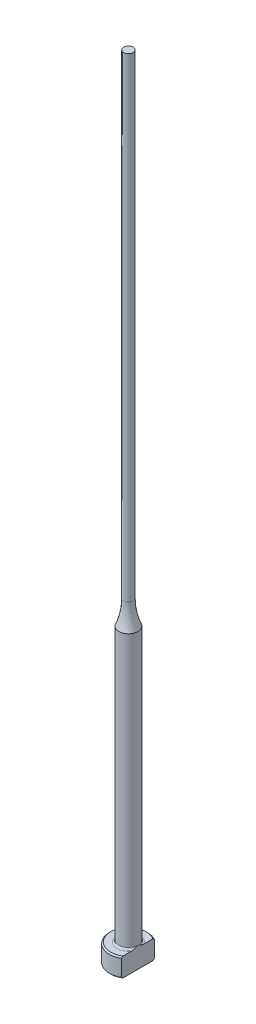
ISO-10303-21;
HEADER;
FILE_DESCRIPTION(('STEP AP214'),'2;1');
FILE_NAME('part.step','',(''),(''),'','','');
FILE_SCHEMA(('AUTOMOTIVE_DESIGN { 1 0 10303 214 1 1 1 1 }'));
ENDSEC;
DATA;
#1=APPLICATION_CONTEXT('core data for automotive mechanical design processes');
#2=APPLICATION_PROTOCOL_DEFINITION('international standard','automotive_design',2000,#1);
#3=PRODUCT_CONTEXT('',#1,'mechanical');
#4=PRODUCT('Part','Part','',(#3));
#5=PRODUCT_RELATED_PRODUCT_CATEGORY('part','',(#4));
#6=PRODUCT_DEFINITION_FORMATION('','',#4);
#7=PRODUCT_DEFINITION_CONTEXT('part definition',#1,'design');
#8=PRODUCT_DEFINITION('design','',#6,#7);
#9=PRODUCT_DEFINITION_SHAPE('','',#8);
#10=(LENGTH_UNIT() NAMED_UNIT(*) SI_UNIT(.MILLI.,.METRE.));
#11=(NAMED_UNIT(*) PLANE_ANGLE_UNIT() SI_UNIT($,.RADIAN.));
#12=(NAMED_UNIT(*) SI_UNIT($,.STERADIAN.) SOLID_ANGLE_UNIT());
#13=UNCERTAINTY_MEASURE_WITH_UNIT(LENGTH_MEASURE(1.E-05),#10,'distance_accuracy_value','');
#14=(GEOMETRIC_REPRESENTATION_CONTEXT(3) GLOBAL_UNCERTAINTY_ASSIGNED_CONTEXT((#13)) GLOBAL_UNIT_ASSIGNED_CONTEXT((#10,
#11,#12)) REPRESENTATION_CONTEXT('',''));
#15=CARTESIAN_POINT('',(0.,0.,0.));
#16=DIRECTION('',(0.,0.,1.));
#17=DIRECTION('',(1.,0.,0.));
#18=AXIS2_PLACEMENT_3D('',#15,#16,#17);
#19=CARTESIAN_POINT('',(-2.99999999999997,3.,0.));
#20=DIRECTION('',(0.,1.,0.));
#21=DIRECTION('',(0.,0.,1.));
#22=AXIS2_PLACEMENT_3D('',#19,#20,#21);
#23=PLANE('',#22);
#24=CARTESIAN_POINT('',(0.,3.,0.));
#25=DIRECTION('',(0.,1.,0.));
#26=DIRECTION('',(0.,0.,1.));
#27=AXIS2_PLACEMENT_3D('',#24,#25,#26);
#28=CIRCLE('',#27,2.79999999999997);
#29=CARTESIAN_POINT('',(1.49999999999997,3.,-2.36431808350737));
#30=VERTEX_POINT('',#29);
#31=CARTESIAN_POINT('',(1.49999999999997,3.,2.36431808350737));
#32=VERTEX_POINT('',#31);
#33=EDGE_CURVE('E187',#30,#32,#28,.T.);
#34=ORIENTED_EDGE('',*,*,#33,.T.);
#35=DIRECTION('',(0.,0.,-1.));
#36=VECTOR('',#35,1.);
#37=CARTESIAN_POINT('',(1.49999999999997,3.,0.));
#38=LINE('',#37,#36);
#39=CARTESIAN_POINT('',(1.49999999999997,3.00000000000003,0.99498743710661));
#40=VERTEX_POINT('',#39);
#41=EDGE_CURVE('E57',#32,#40,#38,.T.);
#42=ORIENTED_EDGE('',*,*,#41,.T.);
#43=CARTESIAN_POINT('',(0.,3.,0.));
#44=DIRECTION('',(0.,1.,0.));
#45=DIRECTION('',(0.,0.,1.));
#46=AXIS2_PLACEMENT_3D('',#43,#44,#45);
#47=CIRCLE('',#46,1.79999999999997);
#48=CARTESIAN_POINT('',(1.49999999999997,3.00000000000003,-0.994987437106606));
#49=VERTEX_POINT('',#48);
#50=EDGE_CURVE('E108',#40,#49,#47,.F.);
#51=ORIENTED_EDGE('',*,*,#50,.T.);
#52=EDGE_CURVE('E137',#49,#30,#38,.T.);
#53=ORIENTED_EDGE('',*,*,#52,.T.);
#54=EDGE_LOOP('',(#34,#42,#51,#53));
#55=FACE_BOUND('',#54,.T.);
#56=ADVANCED_FACE('F32',(#55),#23,.T.);
#57=CARTESIAN_POINT('',(0.,259.958771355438,0.));
#58=DIRECTION('',(0.,1.,0.));
#59=DIRECTION('',(0.,0.,1.));
#60=AXIS2_PLACEMENT_3D('',#57,#58,#59);
#61=CYLINDRICAL_SURFACE('',#60,2.99999999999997);
#62=CARTESIAN_POINT('',(0.,2.80000000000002,0.));
#63=DIRECTION('',(0.,1.,0.));
#64=DIRECTION('',(0.,0.,1.));
#65=AXIS2_PLACEMENT_3D('',#62,#63,#64);
#66=CIRCLE('',#65,2.99999999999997);
#67=CARTESIAN_POINT('',(1.49999999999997,2.80000000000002,2.5980762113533));
#68=VERTEX_POINT('',#67);
#69=CARTESIAN_POINT('',(1.49999999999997,2.80000000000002,-2.5980762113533));
#70=VERTEX_POINT('',#69);
#71=EDGE_CURVE('E105',#68,#70,#66,.F.);
#72=ORIENTED_EDGE('',*,*,#71,.T.);
#73=DIRECTION('',(0.,-1.,0.));
#74=VECTOR('',#73,1.);
#75=CARTESIAN_POINT('',(1.49999999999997,125.,-2.5980762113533));
#76=LINE('',#75,#74);
#77=CARTESIAN_POINT('',(1.49999999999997,0.200000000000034,-2.5980762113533));
#78=VERTEX_POINT('',#77);
#79=EDGE_CURVE('E193',#70,#78,#76,.T.);
#80=ORIENTED_EDGE('',*,*,#79,.T.);
#81=CARTESIAN_POINT('',(0.,0.200000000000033,0.));
#82=DIRECTION('',(0.,-1.,0.));
#83=DIRECTION('',(0.,0.,-1.));
#84=AXIS2_PLACEMENT_3D('',#81,#82,#83);
#85=CIRCLE('',#84,2.99999999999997);
#86=CARTESIAN_POINT('',(1.49999999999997,0.200000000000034,2.5980762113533));
#87=VERTEX_POINT('',#86);
#88=EDGE_CURVE('E100',#78,#87,#85,.F.);
#89=ORIENTED_EDGE('',*,*,#88,.T.);
#90=DIRECTION('',(0.,-1.,0.));
#91=VECTOR('',#90,1.);
#92=CARTESIAN_POINT('',(1.49999999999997,125.,2.5980762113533));
#93=LINE('',#92,#91);
#94=EDGE_CURVE('E93',#68,#87,#93,.T.);
#95=ORIENTED_EDGE('',*,*,#94,.F.);
#96=EDGE_LOOP('',(#72,#80,#89,#95));
#97=FACE_BOUND('',#96,.T.);
#98=ADVANCED_FACE('F158',(#97),#61,.T.);
#99=CARTESIAN_POINT('',(0.,0.,0.));
#100=DIRECTION('',(0.,-1.,0.));
#101=DIRECTION('',(0.,0.,-1.));
#102=AXIS2_PLACEMENT_3D('',#99,#100,#101);
#103=PLANE('',#102);
#104=CARTESIAN_POINT('',(0.,0.,0.));
#105=DIRECTION('',(0.,-1.,0.));
#106=DIRECTION('',(0.,0.,-1.));
#107=AXIS2_PLACEMENT_3D('',#104,#105,#106);
#108=CIRCLE('',#107,2.79999999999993);
#109=CARTESIAN_POINT('',(1.49999999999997,0.,2.36431808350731));
#110=VERTEX_POINT('',#109);
#111=CARTESIAN_POINT('',(1.49999999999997,0.,-2.36431808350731));
#112=VERTEX_POINT('',#111);
#113=EDGE_CURVE('E98',#110,#112,#108,.T.);
#114=ORIENTED_EDGE('',*,*,#113,.T.);
#115=DIRECTION('',(0.,0.,1.));
#116=VECTOR('',#115,1.);
#117=CARTESIAN_POINT('',(1.49999999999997,0.,-2.5980762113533));
#118=LINE('',#117,#116);
#119=EDGE_CURVE('E83',#112,#110,#118,.T.);
#120=ORIENTED_EDGE('',*,*,#119,.T.);
#121=EDGE_LOOP('',(#114,#120));
#122=FACE_BOUND('',#121,.T.);
#123=ADVANCED_FACE('F103',(#122),#103,.T.);
#124=CARTESIAN_POINT('',(0.,3.,0.));
#125=DIRECTION('',(0.,-1.,0.));
#126=DIRECTION('',(0.,0.,-1.));
#127=AXIS2_PLACEMENT_3D('',#124,#125,#126);
#128=CONICAL_SURFACE('',#127,2.79999999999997,0.7853981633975);
#129=ORIENTED_EDGE('',*,*,#71,.F.);
#130=CARTESIAN_POINT('',(1.49999999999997,-0.11174109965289,5.71827621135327));
#131=CARTESIAN_POINT('',(1.49999999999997,0.0136183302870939,5.58866816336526));
#132=CARTESIAN_POINT('',(1.49999999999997,0.138843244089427,5.45892957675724));
#133=CARTESIAN_POINT('',(1.49999999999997,0.388944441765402,5.19911365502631));
#134=CARTESIAN_POINT('',(1.49999999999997,0.513820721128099,5.06903631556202));
#135=CARTESIAN_POINT('',(1.49999999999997,0.763205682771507,4.8084018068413));
#136=CARTESIAN_POINT('',(1.49999999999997,0.887714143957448,4.67784442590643));
#137=CARTESIAN_POINT('',(1.49999999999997,1.13618059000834,4.41620813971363));
#138=CARTESIAN_POINT('',(1.49999999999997,1.2601385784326,4.28512923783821));
#139=CARTESIAN_POINT('',(1.49999999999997,1.50488975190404,4.02490837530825));
#140=CARTESIAN_POINT('',(1.49999999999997,1.6256969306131,3.89577958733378));
#141=CARTESIAN_POINT('',(1.49999999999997,1.86640694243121,3.63668213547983));
#142=CARTESIAN_POINT('',(1.49999999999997,1.98630978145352,3.5067134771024));
#143=CARTESIAN_POINT('',(1.49999999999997,2.22486033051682,3.24567921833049));
#144=CARTESIAN_POINT('',(1.49999999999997,2.34350830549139,3.11461386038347));
#145=CARTESIAN_POINT('',(1.49999999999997,2.57907716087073,2.85094268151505));
#146=CARTESIAN_POINT('',(1.49999999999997,2.69599811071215,2.71833692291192));
#147=CARTESIAN_POINT('',(1.49999999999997,2.88262371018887,2.50255231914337));
#148=CARTESIAN_POINT('',(1.49999999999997,2.95312454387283,2.42006293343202));
#149=CARTESIAN_POINT('',(1.49999999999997,3.09287098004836,2.25401084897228));
#150=CARTESIAN_POINT('',(1.49999999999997,3.16211645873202,2.170448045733));
#151=CARTESIAN_POINT('',(1.49999999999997,3.2996468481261,2.00105967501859));
#152=CARTESIAN_POINT('',(1.49999999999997,3.36791386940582,1.91521952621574));
#153=CARTESIAN_POINT('',(1.49999999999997,3.50205840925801,1.74171392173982));
#154=CARTESIAN_POINT('',(1.49999999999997,3.56793649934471,1.65404891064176));
#155=CARTESIAN_POINT('',(1.49999999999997,3.69728151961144,1.47490236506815));
#156=CARTESIAN_POINT('',(1.49999999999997,3.76069661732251,1.38338308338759));
#157=CARTESIAN_POINT('',(1.49999999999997,3.88239539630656,1.1967566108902));
#158=CARTESIAN_POINT('',(1.49999999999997,3.94067201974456,1.10164473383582));
#159=CARTESIAN_POINT('',(1.49999999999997,4.0484132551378,0.908008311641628));
#160=CARTESIAN_POINT('',(1.49999999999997,4.09797809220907,0.809540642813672));
#161=CARTESIAN_POINT('',(1.49999999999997,4.18432188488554,0.607192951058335));
#162=CARTESIAN_POINT('',(1.49999999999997,4.22114374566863,0.503332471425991));
#163=CARTESIAN_POINT('',(1.49999999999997,4.26099935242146,0.347577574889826));
#164=CARTESIAN_POINT('',(1.49999999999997,4.27157029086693,0.29760995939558));
#165=CARTESIAN_POINT('',(1.49999999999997,4.28794860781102,0.196885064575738));
#166=CARTESIAN_POINT('',(1.49999999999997,4.29375640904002,0.146127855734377));
#167=CARTESIAN_POINT('',(1.49999999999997,4.30019707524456,0.0444388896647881));
#168=CARTESIAN_POINT('',(1.49999999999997,4.30084594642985,-0.00649183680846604));
#169=CARTESIAN_POINT('',(1.49999999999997,4.29696416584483,-0.108155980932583));
#170=CARTESIAN_POINT('',(1.49999999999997,4.29243308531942,-0.158889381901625));
#171=CARTESIAN_POINT('',(1.49999999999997,4.27856915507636,-0.259234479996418));
#172=CARTESIAN_POINT('',(1.49999999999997,4.26927821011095,-0.308852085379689));
#173=CARTESIAN_POINT('',(1.49999999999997,4.24647108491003,-0.407110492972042));
#174=CARTESIAN_POINT('',(1.49999999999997,4.2329532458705,-0.455750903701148));
#175=CARTESIAN_POINT('',(1.49999999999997,4.20226175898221,-0.552149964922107));
#176=CARTESIAN_POINT('',(1.49999999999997,4.18506801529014,-0.599902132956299));
#177=CARTESIAN_POINT('',(1.49999999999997,4.14771387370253,-0.694205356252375));
#178=CARTESIAN_POINT('',(1.49999999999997,4.12755408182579,-0.740756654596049));
#179=CARTESIAN_POINT('',(1.49999999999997,4.06327696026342,-0.879166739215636));
#180=CARTESIAN_POINT('',(1.49999999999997,4.01551721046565,-0.969329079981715));
#181=CARTESIAN_POINT('',(1.49999999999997,3.91367909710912,-1.1460431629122));
#182=CARTESIAN_POINT('',(1.49999999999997,3.85959300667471,-1.23259031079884));
#183=CARTESIAN_POINT('',(1.49999999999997,3.74697968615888,-1.40321348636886));
#184=CARTESIAN_POINT('',(1.49999999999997,3.68843573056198,-1.48727838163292));
#185=CARTESIAN_POINT('',(1.49999999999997,3.56843845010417,-1.65322187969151));
#186=CARTESIAN_POINT('',(1.49999999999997,3.50698656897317,-1.73510153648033));
#187=CARTESIAN_POINT('',(1.49999999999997,3.38115673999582,-1.89829823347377));
#188=CARTESIAN_POINT('',(1.49999999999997,3.31675092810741,-1.9795936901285));
#189=CARTESIAN_POINT('',(1.49999999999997,3.18634068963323,-2.14090082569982));
#190=CARTESIAN_POINT('',(1.49999999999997,3.12033609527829,-2.22091236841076));
#191=CARTESIAN_POINT('',(1.49999999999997,2.9208643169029,-2.4590650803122));
#192=CARTESIAN_POINT('',(1.49999999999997,2.78562663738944,-2.6157209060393));
#193=CARTESIAN_POINT('',(1.49999999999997,2.53554498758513,-2.90006295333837));
#194=CARTESIAN_POINT('',(1.49999999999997,2.421145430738,-3.02814382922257));
#195=CARTESIAN_POINT('',(1.49999999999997,2.19093557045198,-3.28303767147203));
#196=CARTESIAN_POINT('',(1.49999999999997,2.07512522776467,-3.40985060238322));
#197=CARTESIAN_POINT('',(1.49999999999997,1.72597067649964,-3.78913849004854));
#198=CARTESIAN_POINT('',(1.49999999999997,1.49111760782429,-4.04022177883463));
#199=CARTESIAN_POINT('',(1.49999999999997,1.02882478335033,-4.52992803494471));
#200=CARTESIAN_POINT('',(1.49999999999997,0.801477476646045,-4.76863870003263));
#201=CARTESIAN_POINT('',(1.49999999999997,0.459548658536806,-5.12558036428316));
#202=CARTESIAN_POINT('',(1.49999999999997,0.345484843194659,-5.24430773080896));
#203=CARTESIAN_POINT('',(1.49999999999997,0.117071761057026,-5.48148573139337));
#204=CARTESIAN_POINT('',(1.49999999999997,0.00272249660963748,-5.59993636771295));
#205=CARTESIAN_POINT('',(1.49999999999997,-0.111741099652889,-5.71827621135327));
#206=B_SPLINE_CURVE_WITH_KNOTS('',3,(#130,#131,#132,#133,#134,#135,#136,#137,#138,#139,#140,
#141,#142,#143,#144,#145,#146,#147,#148,#149,#150,#151,#152,#153,#154,#155,#156,#157,#158,#159,
#160,#161,#162,#163,#164,#165,#166,#167,#168,#169,#170,#171,#172,#173,#174,#175,#176,#177,#178,
#179,#180,#181,#182,#183,#184,#185,#186,#187,#188,#189,#190,#191,#192,#193,#194,#195,#196,#197,
#198,#199,#200,#201,#202,#203,#204,#205),.UNSPECIFIED.,.F.,.F.,(4,2,2,2,2,2,2,2,2,2,2,2,2,2,2,2,
2,2,2,2,2,2,2,2,2,2,2,2,2,2,2,2,2,2,2,2,2,4),(0.,0.540943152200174,1.08189327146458,
1.62312052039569,2.16434426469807,2.69482920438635,3.22531067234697,3.75567781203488,
4.28602356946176,4.61155053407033,4.93710943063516,5.26610945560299,5.59503024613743,
5.92894782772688,6.26331713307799,6.59354403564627,6.92264800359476,7.07567478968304,
7.22868799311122,7.38122626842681,7.53377717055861,7.68500755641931,7.83629736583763,
7.98843643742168,8.14054446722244,8.4461879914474,8.75220879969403,9.05944044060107,
9.366521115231,9.677642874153,9.98879742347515,10.6095925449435,11.1247803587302,
11.6399825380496,12.6713544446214,13.6603005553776,14.1542238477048,14.648143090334),.UNSPECIFIED.);
#207=EDGE_CURVE('E136',#68,#32,#206,.T.);
#208=ORIENTED_EDGE('',*,*,#207,.T.);
#209=ORIENTED_EDGE('',*,*,#33,.F.);
#210=EDGE_CURVE('E128',#30,#70,#206,.T.);
#211=ORIENTED_EDGE('',*,*,#210,.T.);
#212=EDGE_LOOP('',(#129,#208,#209,#211));
#213=FACE_BOUND('',#212,.T.);
#214=ADVANCED_FACE('F144',(#213),#128,.T.);
#215=CARTESIAN_POINT('',(0.,0.200000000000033,0.));
#216=DIRECTION('',(0.,1.,0.));
#217=DIRECTION('',(0.,0.,1.));
#218=AXIS2_PLACEMENT_3D('',#215,#216,#217);
#219=CONICAL_SURFACE('',#218,2.99999999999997,0.785398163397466);
#220=ORIENTED_EDGE('',*,*,#88,.F.);
#221=CARTESIAN_POINT('',(1.49999999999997,3.11174109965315,-5.71827621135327));
#222=CARTESIAN_POINT('',(1.49999999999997,2.98638166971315,-5.58866816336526));
#223=CARTESIAN_POINT('',(1.49999999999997,2.8611567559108,-5.45892957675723));
#224=CARTESIAN_POINT('',(1.49999999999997,2.6110555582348,-5.19911365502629));
#225=CARTESIAN_POINT('',(1.49999999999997,2.48617927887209,-5.06903631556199));
#226=CARTESIAN_POINT('',(1.49999999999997,2.23679431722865,-4.80840180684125));
#227=CARTESIAN_POINT('',(1.49999999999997,2.11228585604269,-4.67784442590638));
#228=CARTESIAN_POINT('',(1.49999999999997,1.86381940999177,-4.41620813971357));
#229=CARTESIAN_POINT('',(1.49999999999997,1.7398614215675,-4.28512923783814));
#230=CARTESIAN_POINT('',(1.49999999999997,1.49511024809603,-4.02490837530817));
#231=CARTESIAN_POINT('',(1.49999999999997,1.37430306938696,-3.89577958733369));
#232=CARTESIAN_POINT('',(1.49999999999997,1.13359305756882,-3.63668213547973));
#233=CARTESIAN_POINT('',(1.49999999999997,1.0136902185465,-3.50671347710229));
#234=CARTESIAN_POINT('',(1.49999999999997,0.775139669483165,-3.24567921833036));
#235=CARTESIAN_POINT('',(1.49999999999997,0.656491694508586,-3.11461386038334));
#236=CARTESIAN_POINT('',(1.49999999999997,0.420922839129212,-2.85094268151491));
#237=CARTESIAN_POINT('',(1.49999999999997,0.304001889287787,-2.71833692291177));
#238=CARTESIAN_POINT('',(1.49999999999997,0.117376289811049,-2.50255231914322));
#239=CARTESIAN_POINT('',(1.49999999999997,0.0468754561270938,-2.42006293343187));
#240=CARTESIAN_POINT('',(1.49999999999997,-0.0928709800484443,-2.25401084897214));
#241=CARTESIAN_POINT('',(1.49999999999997,-0.162116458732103,-2.17044804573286));
#242=CARTESIAN_POINT('',(1.49999999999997,-0.299646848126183,-2.00105967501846));
#243=CARTESIAN_POINT('',(1.49999999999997,-0.367913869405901,-1.91521952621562));
#244=CARTESIAN_POINT('',(1.49999999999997,-0.502058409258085,-1.74171392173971));
#245=CARTESIAN_POINT('',(1.49999999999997,-0.567936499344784,-1.65404891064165));
#246=CARTESIAN_POINT('',(1.49999999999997,-0.697281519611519,-1.47490236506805));
#247=CARTESIAN_POINT('',(1.49999999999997,-0.760696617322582,-1.38338308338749));
#248=CARTESIAN_POINT('',(1.49999999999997,-0.882395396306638,-1.19675661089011));
#249=CARTESIAN_POINT('',(1.49999999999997,-0.940672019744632,-1.10164473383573));
#250=CARTESIAN_POINT('',(1.49999999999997,-1.04841325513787,-0.908008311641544));
#251=CARTESIAN_POINT('',(1.49999999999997,-1.09797809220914,-0.809540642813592));
#252=CARTESIAN_POINT('',(1.49999999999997,-1.1843218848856,-0.60719295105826));
#253=CARTESIAN_POINT('',(1.49999999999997,-1.22114374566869,-0.503332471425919));
#254=CARTESIAN_POINT('',(1.49999999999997,-1.26099935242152,-0.347577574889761));
#255=CARTESIAN_POINT('',(1.49999999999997,-1.27157029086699,-0.29760995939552));
#256=CARTESIAN_POINT('',(1.49999999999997,-1.28794860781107,-0.196885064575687));
#257=CARTESIAN_POINT('',(1.49999999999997,-1.29375640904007,-0.146127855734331));
#258=CARTESIAN_POINT('',(1.49999999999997,-1.30019707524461,-0.0444388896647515));
#259=CARTESIAN_POINT('',(1.49999999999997,-1.3008459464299,0.00649183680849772));
#260=CARTESIAN_POINT('',(1.49999999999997,-1.29696416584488,0.108155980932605));
#261=CARTESIAN_POINT('',(1.49999999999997,-1.29243308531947,0.158889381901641));
#262=CARTESIAN_POINT('',(1.49999999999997,-1.2785691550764,0.259234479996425));
#263=CARTESIAN_POINT('',(1.49999999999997,-1.26927821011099,0.308852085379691));
#264=CARTESIAN_POINT('',(1.49999999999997,-1.24647108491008,0.407110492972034));
#265=CARTESIAN_POINT('',(1.49999999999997,-1.23295324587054,0.455750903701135));
#266=CARTESIAN_POINT('',(1.49999999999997,-1.20226175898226,0.552149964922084));
#267=CARTESIAN_POINT('',(1.49999999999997,-1.18506801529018,0.599902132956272));
#268=CARTESIAN_POINT('',(1.49999999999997,-1.14771387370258,0.694205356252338));
#269=CARTESIAN_POINT('',(1.49999999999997,-1.12755408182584,0.740756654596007));
#270=CARTESIAN_POINT('',(1.49999999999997,-1.06327696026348,0.879166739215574));
#271=CARTESIAN_POINT('',(1.49999999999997,-1.01551721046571,0.969329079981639));
#272=CARTESIAN_POINT('',(1.49999999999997,-0.913679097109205,1.1460431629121));
#273=CARTESIAN_POINT('',(1.49999999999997,-0.8595930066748,1.23259031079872));
#274=CARTESIAN_POINT('',(1.49999999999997,-0.746979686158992,1.40321348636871));
#275=CARTESIAN_POINT('',(1.49999999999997,-0.688435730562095,1.48727838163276));
#276=CARTESIAN_POINT('',(1.49999999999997,-0.568438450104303,1.65322187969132));
#277=CARTESIAN_POINT('',(1.49999999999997,-0.506986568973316,1.73510153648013));
#278=CARTESIAN_POINT('',(1.49999999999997,-0.381156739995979,1.89829823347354));
#279=CARTESIAN_POINT('',(1.49999999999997,-0.316750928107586,1.97959369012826));
#280=CARTESIAN_POINT('',(1.49999999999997,-0.186340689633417,2.14090082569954));
#281=CARTESIAN_POINT('',(1.49999999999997,-0.120336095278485,2.22091236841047));
#282=CARTESIAN_POINT('',(1.49999999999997,0.0791356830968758,2.45906508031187));
#283=CARTESIAN_POINT('',(1.49999999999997,0.214373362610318,2.61572090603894));
#284=CARTESIAN_POINT('',(1.49999999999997,0.46445501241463,2.90006295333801));
#285=CARTESIAN_POINT('',(1.49999999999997,0.578854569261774,3.02814382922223));
#286=CARTESIAN_POINT('',(1.49999999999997,0.809064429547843,3.28303767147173));
#287=CARTESIAN_POINT('',(1.49999999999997,0.924874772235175,3.40985060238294));
#288=CARTESIAN_POINT('',(1.49999999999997,1.27402932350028,3.78913849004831));
#289=CARTESIAN_POINT('',(1.49999999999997,1.50888239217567,4.04022177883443));
#290=CARTESIAN_POINT('',(1.49999999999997,1.97117521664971,4.52992803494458));
#291=CARTESIAN_POINT('',(1.49999999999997,2.19852252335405,4.76863870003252));
#292=CARTESIAN_POINT('',(1.49999999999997,2.54045134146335,5.12558036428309));
#293=CARTESIAN_POINT('',(1.49999999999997,2.65451515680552,5.2443077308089));
#294=CARTESIAN_POINT('',(1.49999999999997,2.88292823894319,5.48148573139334));
#295=CARTESIAN_POINT('',(1.49999999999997,2.9972775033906,5.59993636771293));
#296=CARTESIAN_POINT('',(1.49999999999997,3.11174109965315,5.71827621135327));
#297=B_SPLINE_CURVE_WITH_KNOTS('',3,(#221,#222,#223,#224,#225,#226,#227,#228,#229,#230,#231,
#232,#233,#234,#235,#236,#237,#238,#239,#240,#241,#242,#243,#244,#245,#246,#247,#248,#249,#250,
#251,#252,#253,#254,#255,#256,#257,#258,#259,#260,#261,#262,#263,#264,#265,#266,#267,#268,#269,
#270,#271,#272,#273,#274,#275,#276,#277,#278,#279,#280,#281,#282,#283,#284,#285,#286,#287,#288,
#289,#290,#291,#292,#293,#294,#295,#296),.UNSPECIFIED.,.F.,.F.,(4,2,2,2,2,2,2,2,2,2,2,2,2,2,2,2,
2,2,2,2,2,2,2,2,2,2,2,2,2,2,2,2,2,2,2,2,2,4),(0.,0.540943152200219,1.08189327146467,
1.62312052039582,2.16434426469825,2.69482920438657,3.22531067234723,3.75567781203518,
4.28602356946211,4.61155053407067,4.93710943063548,5.2661094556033,5.59503024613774,
5.92894782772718,6.26331713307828,6.59354403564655,6.92264800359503,7.0756747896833,
7.22868799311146,7.38122626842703,7.53377717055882,7.68500755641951,7.83629736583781,
7.98843643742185,8.14054446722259,8.4461879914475,8.75220879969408,9.05944044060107,
9.36652111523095,9.6776428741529,9.98879742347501,10.6095925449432,11.1247803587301,
11.6399825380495,12.6713544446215,13.6603005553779,14.1542238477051,14.6481430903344),.UNSPECIFIED.);
#298=EDGE_CURVE('E86',#78,#112,#297,.T.);
#299=ORIENTED_EDGE('',*,*,#298,.T.);
#300=ORIENTED_EDGE('',*,*,#113,.F.);
#301=EDGE_CURVE('E89',#110,#87,#297,.T.);
#302=ORIENTED_EDGE('',*,*,#301,.T.);
#303=EDGE_LOOP('',(#220,#299,#300,#302));
#304=FACE_BOUND('',#303,.T.);
#305=ADVANCED_FACE('F97',(#304),#219,.T.);
#306=CARTESIAN_POINT('',(0.,3.30000000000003,0.));
#307=DIRECTION('',(0.,1.,0.));
#308=DIRECTION('',(0.,0.,1.));
#309=AXIS2_PLACEMENT_3D('',#306,#307,#308);
#310=TOROIDAL_SURFACE('',#309,1.79999999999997,0.3);
#311=CARTESIAN_POINT('',(1.49999999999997,3.30000000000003,0.));
#312=CARTESIAN_POINT('',(1.49999999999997,3.300000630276,3.41555678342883E-12));
#313=CARTESIAN_POINT('',(1.49999999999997,3.30000126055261,-1.15373640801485E-07));
#314=CARTESIAN_POINT('',(1.49999999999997,3.3000024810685,-4.90631575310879E-07));
#315=CARTESIAN_POINT('',(1.49999999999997,3.30000307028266,-7.53296670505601E-07));
#316=CARTESIAN_POINT('',(1.49999999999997,3.30000424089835,-1.38757096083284E-06));
#317=CARTESIAN_POINT('',(1.49999999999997,3.300004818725,-1.76563001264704E-06));
#318=CARTESIAN_POINT('',(1.49999999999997,3.30000591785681,-2.58768006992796E-06));
#319=CARTESIAN_POINT('',(1.49999999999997,3.30000643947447,-3.03127014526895E-06));
#320=CARTESIAN_POINT('',(1.49999999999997,3.30000815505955,-4.60021967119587E-06));
#321=CARTESIAN_POINT('',(1.49999999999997,3.30000927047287,-5.8124152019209E-06));
#322=CARTESIAN_POINT('',(1.49999999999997,3.30001128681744,-8.33989413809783E-06));
#323=CARTESIAN_POINT('',(1.49999999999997,3.30001219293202,-9.65128157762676E-06));
#324=CARTESIAN_POINT('',(1.49999999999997,3.30001551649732,-1.46782505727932E-05));
#325=CARTESIAN_POINT('',(1.49999999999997,3.30001775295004,-1.8517976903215E-05));
#326=CARTESIAN_POINT('',(1.49999999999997,3.30002148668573,-2.61616194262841E-05));
#327=CARTESIAN_POINT('',(1.49999999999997,3.30002302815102,-2.99447742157E-05));
#328=CARTESIAN_POINT('',(1.49999999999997,3.30002943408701,-4.58003743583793E-05));
#329=CARTESIAN_POINT('',(1.49999999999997,3.3000341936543,-5.79079078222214E-05));
#330=CARTESIAN_POINT('',(1.49999999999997,3.30004197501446,-8.07263755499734E-05));
#331=CARTESIAN_POINT('',(1.49999999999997,3.30004514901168,-9.13834709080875E-05));
#332=CARTESIAN_POINT('',(1.49999999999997,3.30006989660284,-0.000167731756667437));
#333=CARTESIAN_POINT('',(1.49999999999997,3.30010092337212,-0.000229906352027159));
#334=CARTESIAN_POINT('',(1.49999999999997,3.30021632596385,-0.000470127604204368));
#335=CARTESIAN_POINT('',(1.49999999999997,3.30029368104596,-0.000650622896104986));
#336=CARTESIAN_POINT('',(1.49999999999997,3.30059619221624,-0.00134589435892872));
#337=CARTESIAN_POINT('',(1.49999999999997,3.30082870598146,-0.00185814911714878));
#338=CARTESIAN_POINT('',(1.49999999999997,3.30176696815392,-0.00393547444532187));
#339=CARTESIAN_POINT('',(1.49999999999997,3.30246445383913,-0.00550332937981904));
#340=CARTESIAN_POINT('',(1.49999999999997,3.31426785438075,-0.0320229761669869));
#341=CARTESIAN_POINT('',(1.49999999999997,3.32544800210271,-0.0569503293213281));
#342=CARTESIAN_POINT('',(1.49999999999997,3.34725700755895,-0.105984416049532));
#343=CARTESIAN_POINT('',(1.49999999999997,3.35789134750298,-0.130088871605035));
#344=CARTESIAN_POINT('',(1.49999999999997,3.38015321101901,-0.181096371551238));
#345=CARTESIAN_POINT('',(1.49999999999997,3.39175804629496,-0.208009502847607));
#346=CARTESIAN_POINT('',(1.49999999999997,3.41469034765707,-0.262264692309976));
#347=CARTESIAN_POINT('',(1.49999999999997,3.42601398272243,-0.289608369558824));
#348=CARTESIAN_POINT('',(1.49999999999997,3.45363212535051,-0.35820378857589));
#349=CARTESIAN_POINT('',(1.49999999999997,3.46959026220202,-0.39959288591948));
#350=CARTESIAN_POINT('',(1.49999999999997,3.49940505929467,-0.482097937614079));
#351=CARTESIAN_POINT('',(1.49999999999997,3.51330033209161,-0.523199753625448));
#352=CARTESIAN_POINT('',(1.49999999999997,3.53552507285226,-0.595497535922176));
#353=CARTESIAN_POINT('',(1.49999999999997,3.54436834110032,-0.626532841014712));
#354=CARTESIAN_POINT('',(1.49999999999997,3.56052427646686,-0.6891760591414));
#355=CARTESIAN_POINT('',(1.49999999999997,3.5678279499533,-0.720786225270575));
#356=CARTESIAN_POINT('',(1.49999999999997,3.5875075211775,-0.819524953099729));
#357=CARTESIAN_POINT('',(1.49999999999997,3.59661044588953,-0.88742909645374));
#358=CARTESIAN_POINT('',(1.49999999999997,3.60059842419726,-0.991180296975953));
#359=CARTESIAN_POINT('',(1.49999999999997,3.60019840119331,-1.02684364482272));
#360=CARTESIAN_POINT('',(1.49999999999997,3.59497085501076,-1.097505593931));
#361=CARTESIAN_POINT('',(1.49999999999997,3.59019295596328,-1.13250716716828));
#362=CARTESIAN_POINT('',(1.49999999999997,3.57687734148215,-1.19353096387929));
#363=CARTESIAN_POINT('',(1.49999999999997,3.56943875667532,-1.21978854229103));
#364=CARTESIAN_POINT('',(1.49999999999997,3.55063748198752,-1.27094658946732));
#365=CARTESIAN_POINT('',(1.49999999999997,3.53927342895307,-1.29584658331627));
#366=CARTESIAN_POINT('',(1.49999999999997,3.51660016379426,-1.33501873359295));
#367=CARTESIAN_POINT('',(1.49999999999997,3.50657738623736,-1.35003296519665));
#368=CARTESIAN_POINT('',(1.49999999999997,3.48437469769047,-1.37837252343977));
#369=CARTESIAN_POINT('',(1.49999999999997,3.47219867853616,-1.39170082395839));
#370=CARTESIAN_POINT('',(1.49999999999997,3.44835614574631,-1.41349417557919));
#371=CARTESIAN_POINT('',(1.49999999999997,3.43709185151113,-1.42239673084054));
#372=CARTESIAN_POINT('',(1.49999999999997,3.41325256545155,-1.43825467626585));
#373=CARTESIAN_POINT('',(1.49999999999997,3.40067804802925,-1.44521076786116));
#374=CARTESIAN_POINT('',(1.49999999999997,3.37433767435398,-1.45677158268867));
#375=CARTESIAN_POINT('',(1.49999999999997,3.36056203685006,-1.46135438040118));
#376=CARTESIAN_POINT('',(1.49999999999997,3.33237324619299,-1.46767730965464));
#377=CARTESIAN_POINT('',(1.49999999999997,3.31796076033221,-1.46942034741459));
#378=CARTESIAN_POINT('',(1.49999999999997,3.29122479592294,-1.4698720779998));
#379=CARTESIAN_POINT('',(1.49999999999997,3.27890664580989,-1.468990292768));
#380=CARTESIAN_POINT('',(1.49999999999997,3.25461019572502,-1.4651157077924));
#381=CARTESIAN_POINT('',(1.49999999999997,3.2426318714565,-1.46212305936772));
#382=CARTESIAN_POINT('',(1.49999999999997,3.21959683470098,-1.4543117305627));
#383=CARTESIAN_POINT('',(1.49999999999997,3.20852542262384,-1.44953579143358));
#384=CARTESIAN_POINT('',(1.49999999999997,3.18721125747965,-1.43840957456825));
#385=CARTESIAN_POINT('',(1.49999999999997,3.1769687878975,-1.43205876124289));
#386=CARTESIAN_POINT('',(1.49999999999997,3.15325976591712,-1.41506353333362));
#387=CARTESIAN_POINT('',(1.49999999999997,3.14027750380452,-1.40374235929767));
#388=CARTESIAN_POINT('',(1.49999999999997,3.11630720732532,-1.37914825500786));
#389=CARTESIAN_POINT('',(1.49999999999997,3.10532420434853,-1.36587054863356));
#390=CARTESIAN_POINT('',(1.49999999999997,3.08100891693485,-1.33197272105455));
#391=CARTESIAN_POINT('',(1.49999999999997,3.06867625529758,-1.31063843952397));
#392=CARTESIAN_POINT('',(1.49999999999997,3.04751867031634,-1.26637455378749));
#393=CARTESIAN_POINT('',(1.49999999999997,3.03869240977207,-1.24344556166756));
#394=CARTESIAN_POINT('',(1.49999999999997,3.01978360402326,-1.18316534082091));
#395=CARTESIAN_POINT('',(1.49999999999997,3.01191472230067,-1.14512623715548));
#396=CARTESIAN_POINT('',(1.49999999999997,3.00188285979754,-1.06789971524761));
#397=CARTESIAN_POINT('',(1.49999999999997,2.99979735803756,-1.02870374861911));
#398=CARTESIAN_POINT('',(1.49999999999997,3.00021727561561,-0.953160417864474));
#399=CARTESIAN_POINT('',(1.49999999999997,3.00240673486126,-0.916808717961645));
#400=CARTESIAN_POINT('',(1.49999999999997,3.0099643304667,-0.844432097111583));
#401=CARTESIAN_POINT('',(1.49999999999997,3.01533462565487,-0.808407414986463));
#402=CARTESIAN_POINT('',(1.49999999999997,3.02828086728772,-0.738670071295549));
#403=CARTESIAN_POINT('',(1.49999999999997,3.03573028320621,-0.704933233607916));
#404=CARTESIAN_POINT('',(1.49999999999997,3.05243174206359,-0.638128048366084));
#405=CARTESIAN_POINT('',(1.49999999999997,3.06167285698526,-0.605056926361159));
#406=CARTESIAN_POINT('',(1.49999999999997,3.08440652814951,-0.53019513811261));
#407=CARTESIAN_POINT('',(1.49999999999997,3.09836576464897,-0.488547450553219));
#408=CARTESIAN_POINT('',(1.49999999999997,3.1283820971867,-0.404954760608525));
#409=CARTESIAN_POINT('',(1.49999999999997,3.14447968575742,-0.363024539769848));
#410=CARTESIAN_POINT('',(1.49999999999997,3.17238454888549,-0.293508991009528));
#411=CARTESIAN_POINT('',(1.49999999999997,3.18384249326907,-0.265781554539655));
#412=CARTESIAN_POINT('',(1.49999999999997,3.20705854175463,-0.210769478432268));
#413=CARTESIAN_POINT('',(1.49999999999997,3.21881265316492,-0.183483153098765));
#414=CARTESIAN_POINT('',(1.49999999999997,3.24136702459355,-0.131772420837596));
#415=CARTESIAN_POINT('',(1.49999999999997,3.25214361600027,-0.107337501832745));
#416=CARTESIAN_POINT('',(1.49999999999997,3.27424746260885,-0.0576321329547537));
#417=CARTESIAN_POINT('',(1.49999999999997,3.28558038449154,-0.0323640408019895));
#418=CARTESIAN_POINT('',(1.49999999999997,3.29753556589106,-0.00550327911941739));
#419=CARTESIAN_POINT('',(1.49999999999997,3.29823307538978,-0.00393537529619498));
#420=CARTESIAN_POINT('',(1.49999999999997,3.29917134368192,-0.00185803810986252));
#421=CARTESIAN_POINT('',(1.49999999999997,3.29940384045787,-0.00134582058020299));
#422=CARTESIAN_POINT('',(1.49999999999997,3.29970633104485,-0.000650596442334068));
#423=CARTESIAN_POINT('',(1.49999999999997,3.29978368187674,-0.000470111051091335));
#424=CARTESIAN_POINT('',(1.49999999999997,3.29989907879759,-0.000229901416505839));
#425=CARTESIAN_POINT('',(1.49999999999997,3.29993010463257,-0.000167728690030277));
#426=CARTESIAN_POINT('',(1.49999999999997,3.29995485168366,-9.13825689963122E-05));
#427=CARTESIAN_POINT('',(1.49999999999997,3.29995802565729,-8.07256241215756E-05));
#428=CARTESIAN_POINT('',(1.49999999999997,3.29996580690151,-5.79074820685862E-05));
#429=CARTESIAN_POINT('',(1.49999999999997,3.29997056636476,-4.5800119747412E-05));
#430=CARTESIAN_POINT('',(1.49999999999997,3.29997697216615,-2.99447119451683E-05));
#431=CARTESIAN_POINT('',(1.49999999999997,3.2999785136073,-2.61615817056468E-05));
#432=CARTESIAN_POINT('',(1.49999999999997,3.2999822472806,-1.85179845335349E-05));
#433=CARTESIAN_POINT('',(1.49999999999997,3.29998448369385,-1.46782782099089E-05));
#434=CARTESIAN_POINT('',(1.49999999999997,3.2999878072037,-9.65132752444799E-06));
#435=CARTESIAN_POINT('',(1.49999999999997,3.299988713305,-8.33994202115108E-06));
#436=CARTESIAN_POINT('',(1.49999999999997,3.29999072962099,-5.81246426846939E-06));
#437=CARTESIAN_POINT('',(1.49999999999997,3.29999184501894,-4.600267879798E-06));
#438=CARTESIAN_POINT('',(1.49999999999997,3.29999356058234,-3.03131394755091E-06));
#439=CARTESIAN_POINT('',(1.49999999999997,3.29999408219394,-2.58772196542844E-06));
#440=CARTESIAN_POINT('',(1.49999999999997,3.2999951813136,-1.76566701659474E-06));
#441=CARTESIAN_POINT('',(1.49999999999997,3.29999575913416,-1.38760497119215E-06));
#442=CARTESIAN_POINT('',(1.49999999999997,3.29999692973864,-7.53323425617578E-07));
#443=CARTESIAN_POINT('',(1.49999999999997,3.29999751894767,-4.90654189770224E-07));
#444=CARTESIAN_POINT('',(1.49999999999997,3.29999873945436,-1.15386267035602E-07));
#445=CARTESIAN_POINT('',(1.49999999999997,3.29999936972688,-3.41554144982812E-12));
#446=CARTESIAN_POINT('',(1.49999999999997,3.30000000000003,0.));
#447=B_SPLINE_CURVE_WITH_KNOTS('',3,(#311,#312,#313,#314,#315,#316,#317,#318,#319,#320,#321,
#322,#323,#324,#325,#326,#327,#328,#329,#330,#331,#332,#333,#334,#335,#336,#337,#338,#339,#340,
#341,#342,#343,#344,#345,#346,#347,#348,#349,#350,#351,#352,#353,#354,#355,#356,#357,#358,#359,
#360,#361,#362,#363,#364,#365,#366,#367,#368,#369,#370,#371,#372,#373,#374,#375,#376,#377,#378,
#379,#380,#381,#382,#383,#384,#385,#386,#387,#388,#389,#390,#391,#392,#393,#394,#395,#396,#397,
#398,#399,#400,#401,#402,#403,#404,#405,#406,#407,#408,#409,#410,#411,#412,#413,#414,#415,#416,
#417,#418,#419,#420,#421,#422,#423,#424,#425,#426,#427,#428,#429,#430,#431,#432,#433,#434,#435,
#436,#437,#438,#439,#440,#441,#442,#443,#444,#445,#446),.UNSPECIFIED.,.T.,.F.,(4,2,2,2,2,2,2,2,
2,2,2,2,2,2,2,2,2,2,2,2,2,2,2,2,2,2,2,2,2,2,2,2,2,2,2,2,2,2,2,2,2,2,2,2,2,2,2,2,2,2,2,2,2,2,2,2,
2,2,2,2,2,2,2,2,2,2,2,4),(0.,1.88906036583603E-06,3.8150959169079E-06,5.87892837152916E-06,
7.93062024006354E-06,1.28480890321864E-05,1.76261717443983E-05,3.0909918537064E-05,
4.31529750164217E-05,8.21699329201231E-05,0.000115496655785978,0.000323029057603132,
0.000912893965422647,0.00259963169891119,0.00774858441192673,0.0896975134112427,
0.168737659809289,0.256660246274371,0.345444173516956,0.478492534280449,0.608603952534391,
0.705372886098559,0.802692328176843,1.00719557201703,1.11399616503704,1.21960092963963,
1.30124317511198,1.38291380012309,1.43690814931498,1.49080588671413,1.53371524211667,
1.57660911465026,1.61989249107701,1.66313154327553,1.69999492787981,1.73685567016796,
1.77288440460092,1.80892540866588,1.86031324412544,1.91182866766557,1.98534297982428,
2.05882922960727,2.1747172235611,2.29215041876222,2.40123170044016,2.51038710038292,
2.613972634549,2.71694519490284,2.84866234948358,2.98337525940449,3.07337666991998,
3.16250453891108,3.24262397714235,3.32569301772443,3.3308421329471,3.33252874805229,
3.33311858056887,3.33332610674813,3.33335943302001,3.33339844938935,3.3334106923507,
3.33342397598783,3.33342875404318,3.33343367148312,3.33343572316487,3.33343778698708,
3.33343971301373,3.33344160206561),.UNSPECIFIED.);
#448=CARTESIAN_POINT('',(1.49999999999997,3.30000000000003,0.));
#449=VERTEX_POINT('',#448);
#450=EDGE_CURVE('E11',#49,#449,#447,.T.);
#451=ORIENTED_EDGE('',*,*,#450,.F.);
#452=ORIENTED_EDGE('',*,*,#50,.F.);
#453=CARTESIAN_POINT('',(1.49999999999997,3.30000000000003,0.));
#454=CARTESIAN_POINT('',(1.49999999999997,3.29999936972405,-3.41547770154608E-12));
#455=CARTESIAN_POINT('',(1.49999999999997,3.29999873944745,1.15373640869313E-07));
#456=CARTESIAN_POINT('',(1.49999999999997,3.29999751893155,4.90631575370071E-07));
#457=CARTESIAN_POINT('',(1.49999999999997,3.29999692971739,7.53296670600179E-07));
#458=CARTESIAN_POINT('',(1.49999999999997,3.2999957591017,1.38757096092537E-06));
#459=CARTESIAN_POINT('',(1.49999999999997,3.29999518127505,1.76563001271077E-06));
#460=CARTESIAN_POINT('',(1.49999999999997,3.29999408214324,2.58768007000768E-06));
#461=CARTESIAN_POINT('',(1.49999999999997,3.29999356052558,3.03127014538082E-06));
#462=CARTESIAN_POINT('',(1.49999999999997,3.2999918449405,4.60021967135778E-06));
#463=CARTESIAN_POINT('',(1.49999999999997,3.29999072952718,5.81241520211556E-06));
#464=CARTESIAN_POINT('',(1.49999999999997,3.29998871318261,8.33989413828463E-06));
#465=CARTESIAN_POINT('',(1.49999999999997,3.29998780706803,9.65128157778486E-06));
#466=CARTESIAN_POINT('',(1.49999999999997,3.29998448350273,1.46782505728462E-05));
#467=CARTESIAN_POINT('',(1.49999999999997,3.29998224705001,1.85179769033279E-05));
#468=CARTESIAN_POINT('',(1.49999999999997,3.29997851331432,2.61616194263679E-05));
#469=CARTESIAN_POINT('',(1.49999999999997,3.29997697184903,2.99447742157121E-05));
#470=CARTESIAN_POINT('',(1.49999999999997,3.29997056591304,4.58003743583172E-05));
#471=CARTESIAN_POINT('',(1.49999999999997,3.29996580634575,5.79079078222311E-05));
#472=CARTESIAN_POINT('',(1.49999999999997,3.29995802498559,8.07263755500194E-05));
#473=CARTESIAN_POINT('',(1.49999999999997,3.29995485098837,9.1383470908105E-05));
#474=CARTESIAN_POINT('',(1.49999999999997,3.29993010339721,0.000167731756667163));
#475=CARTESIAN_POINT('',(1.49999999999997,3.29989907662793,0.000229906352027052));
#476=CARTESIAN_POINT('',(1.49999999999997,3.2997836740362,0.000470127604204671));
#477=CARTESIAN_POINT('',(1.49999999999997,3.2997063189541,0.000650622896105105));
#478=CARTESIAN_POINT('',(1.49999999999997,3.29940380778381,0.00134589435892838));
#479=CARTESIAN_POINT('',(1.49999999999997,3.29917129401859,0.00185814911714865));
#480=CARTESIAN_POINT('',(1.49999999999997,3.29823303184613,0.00393547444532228));
#481=CARTESIAN_POINT('',(1.49999999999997,3.29753554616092,0.00550332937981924));
#482=CARTESIAN_POINT('',(1.49999999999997,3.2857321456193,0.0320229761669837));
#483=CARTESIAN_POINT('',(1.49999999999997,3.27455199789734,0.0569503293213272));
#484=CARTESIAN_POINT('',(1.49999999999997,3.2527429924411,0.105984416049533));
#485=CARTESIAN_POINT('',(1.49999999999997,3.24210865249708,0.130088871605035));
#486=CARTESIAN_POINT('',(1.49999999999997,3.21984678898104,0.181096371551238));
#487=CARTESIAN_POINT('',(1.49999999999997,3.20824195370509,0.208009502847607));
#488=CARTESIAN_POINT('',(1.49999999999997,3.18530965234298,0.262264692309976));
#489=CARTESIAN_POINT('',(1.49999999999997,3.17398601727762,0.289608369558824));
#490=CARTESIAN_POINT('',(1.49999999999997,3.14636787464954,0.35820378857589));
#491=CARTESIAN_POINT('',(1.49999999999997,3.13040973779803,0.39959288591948));
#492=CARTESIAN_POINT('',(1.49999999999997,3.10059494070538,0.482097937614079));
#493=CARTESIAN_POINT('',(1.49999999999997,3.08669966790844,0.523199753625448));
#494=CARTESIAN_POINT('',(1.49999999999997,3.06447492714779,0.595497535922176));
#495=CARTESIAN_POINT('',(1.49999999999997,3.05563165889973,0.626532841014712));
#496=CARTESIAN_POINT('',(1.49999999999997,3.03947572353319,0.6891760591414));
#497=CARTESIAN_POINT('',(1.49999999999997,3.03217205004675,0.720786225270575));
#498=CARTESIAN_POINT('',(1.49999999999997,3.01249247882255,0.819524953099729));
#499=CARTESIAN_POINT('',(1.49999999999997,3.00338955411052,0.88742909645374));
#500=CARTESIAN_POINT('',(1.49999999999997,2.99940157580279,0.991180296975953));
#501=CARTESIAN_POINT('',(1.49999999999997,2.99980159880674,1.02684364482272));
#502=CARTESIAN_POINT('',(1.49999999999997,3.00502914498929,1.097505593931));
#503=CARTESIAN_POINT('',(1.49999999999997,3.00980704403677,1.13250716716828));
#504=CARTESIAN_POINT('',(1.49999999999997,3.0231226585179,1.19353096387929));
#505=CARTESIAN_POINT('',(1.49999999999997,3.03056124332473,1.21978854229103));
#506=CARTESIAN_POINT('',(1.49999999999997,3.04936251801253,1.27094658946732));
#507=CARTESIAN_POINT('',(1.49999999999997,3.06072657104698,1.29584658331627));
#508=CARTESIAN_POINT('',(1.49999999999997,3.08339983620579,1.33501873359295));
#509=CARTESIAN_POINT('',(1.49999999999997,3.09342261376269,1.35003296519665));
#510=CARTESIAN_POINT('',(1.49999999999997,3.11562530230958,1.37837252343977));
#511=CARTESIAN_POINT('',(1.49999999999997,3.12780132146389,1.39170082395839));
#512=CARTESIAN_POINT('',(1.49999999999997,3.15164385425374,1.41349417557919));
#513=CARTESIAN_POINT('',(1.49999999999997,3.16290814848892,1.42239673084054));
#514=CARTESIAN_POINT('',(1.49999999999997,3.1867474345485,1.43825467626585));
#515=CARTESIAN_POINT('',(1.49999999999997,3.1993219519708,1.44521076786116));
#516=CARTESIAN_POINT('',(1.49999999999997,3.22566232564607,1.45677158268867));
#517=CARTESIAN_POINT('',(1.49999999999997,3.23943796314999,1.46135438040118));
#518=CARTESIAN_POINT('',(1.49999999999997,3.26762675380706,1.46767730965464));
#519=CARTESIAN_POINT('',(1.49999999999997,3.28203923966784,1.46942034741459));
#520=CARTESIAN_POINT('',(1.49999999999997,3.30877520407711,1.4698720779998));
#521=CARTESIAN_POINT('',(1.49999999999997,3.32109335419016,1.468990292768));
#522=CARTESIAN_POINT('',(1.49999999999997,3.34538980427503,1.4651157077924));
#523=CARTESIAN_POINT('',(1.49999999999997,3.35736812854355,1.46212305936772));
#524=CARTESIAN_POINT('',(1.49999999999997,3.38040316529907,1.4543117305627));
#525=CARTESIAN_POINT('',(1.49999999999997,3.39147457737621,1.44953579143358));
#526=CARTESIAN_POINT('',(1.49999999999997,3.4127887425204,1.43840957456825));
#527=CARTESIAN_POINT('',(1.49999999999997,3.42303121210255,1.43205876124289));
#528=CARTESIAN_POINT('',(1.49999999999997,3.44674023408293,1.41506353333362));
#529=CARTESIAN_POINT('',(1.49999999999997,3.45972249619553,1.40374235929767));
#530=CARTESIAN_POINT('',(1.49999999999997,3.48369279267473,1.37914825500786));
#531=CARTESIAN_POINT('',(1.49999999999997,3.49467579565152,1.36587054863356));
#532=CARTESIAN_POINT('',(1.49999999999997,3.5189910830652,1.33197272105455));
#533=CARTESIAN_POINT('',(1.49999999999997,3.53132374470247,1.31063843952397));
#534=CARTESIAN_POINT('',(1.49999999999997,3.55248132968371,1.26637455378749));
#535=CARTESIAN_POINT('',(1.49999999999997,3.56130759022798,1.24344556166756));
#536=CARTESIAN_POINT('',(1.49999999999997,3.58021639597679,1.18316534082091));
#537=CARTESIAN_POINT('',(1.49999999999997,3.58808527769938,1.14512623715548));
#538=CARTESIAN_POINT('',(1.49999999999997,3.59811714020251,1.06789971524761));
#539=CARTESIAN_POINT('',(1.49999999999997,3.60020264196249,1.02870374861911));
#540=CARTESIAN_POINT('',(1.49999999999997,3.59978272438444,0.953160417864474));
#541=CARTESIAN_POINT('',(1.49999999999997,3.59759326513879,0.916808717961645));
#542=CARTESIAN_POINT('',(1.49999999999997,3.59003566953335,0.844432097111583));
#543=CARTESIAN_POINT('',(1.49999999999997,3.58466537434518,0.808407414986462));
#544=CARTESIAN_POINT('',(1.49999999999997,3.57171913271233,0.738670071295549));
#545=CARTESIAN_POINT('',(1.49999999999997,3.56426971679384,0.704933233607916));
#546=CARTESIAN_POINT('',(1.49999999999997,3.54756825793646,0.638128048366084));
#547=CARTESIAN_POINT('',(1.49999999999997,3.53832714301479,0.605056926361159));
#548=CARTESIAN_POINT('',(1.49999999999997,3.51559347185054,0.53019513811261));
#549=CARTESIAN_POINT('',(1.49999999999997,3.50163423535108,0.488547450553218));
#550=CARTESIAN_POINT('',(1.49999999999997,3.47161790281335,0.404954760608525));
#551=CARTESIAN_POINT('',(1.49999999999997,3.45552031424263,0.363024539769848));
#552=CARTESIAN_POINT('',(1.49999999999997,3.42761545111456,0.293508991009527));
#553=CARTESIAN_POINT('',(1.49999999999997,3.41615750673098,0.265781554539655));
#554=CARTESIAN_POINT('',(1.49999999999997,3.39294145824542,0.210769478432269));
#555=CARTESIAN_POINT('',(1.49999999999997,3.38118734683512,0.183483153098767));
#556=CARTESIAN_POINT('',(1.49999999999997,3.3586329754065,0.131772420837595));
#557=CARTESIAN_POINT('',(1.49999999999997,3.3478563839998,0.10733750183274));
#558=CARTESIAN_POINT('',(1.49999999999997,3.32575253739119,0.0576321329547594));
#559=CARTESIAN_POINT('',(1.49999999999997,3.31441961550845,0.0323640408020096));
#560=CARTESIAN_POINT('',(1.49999999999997,3.30246443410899,0.00550327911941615));
#561=CARTESIAN_POINT('',(1.49999999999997,3.30176692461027,0.00393537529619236));
#562=CARTESIAN_POINT('',(1.49999999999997,3.30082865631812,0.00185803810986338));
#563=CARTESIAN_POINT('',(1.49999999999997,3.30059615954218,0.00134582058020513));
#564=CARTESIAN_POINT('',(1.49999999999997,3.3002936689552,0.000650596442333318));
#565=CARTESIAN_POINT('',(1.49999999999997,3.30021631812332,0.000470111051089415));
#566=CARTESIAN_POINT('',(1.49999999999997,3.30010092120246,0.000229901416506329));
#567=CARTESIAN_POINT('',(1.49999999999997,3.30006989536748,0.000167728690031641));
#568=CARTESIAN_POINT('',(1.49999999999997,3.30004514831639,9.13825689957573E-05));
#569=CARTESIAN_POINT('',(1.49999999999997,3.30004197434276,8.07256241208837E-05));
#570=CARTESIAN_POINT('',(1.49999999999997,3.30003419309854,5.79074820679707E-05));
#571=CARTESIAN_POINT('',(1.49999999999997,3.30002943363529,4.58001197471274E-05));
#572=CARTESIAN_POINT('',(1.49999999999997,3.3000230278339,2.99447119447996E-05));
#573=CARTESIAN_POINT('',(1.49999999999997,3.30002148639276,2.61615817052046E-05));
#574=CARTESIAN_POINT('',(1.49999999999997,3.30001775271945,1.85179845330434E-05));
#575=CARTESIAN_POINT('',(1.49999999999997,3.3000155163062,1.46782782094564E-05));
#576=CARTESIAN_POINT('',(1.49999999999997,3.30001219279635,9.65132752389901E-06));
#577=CARTESIAN_POINT('',(1.49999999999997,3.30001128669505,8.33994202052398E-06));
#578=CARTESIAN_POINT('',(1.49999999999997,3.30000927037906,5.8124642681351E-06));
#579=CARTESIAN_POINT('',(1.49999999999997,3.30000815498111,4.60026787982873E-06));
#580=CARTESIAN_POINT('',(1.49999999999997,3.30000643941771,3.03131394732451E-06));
#581=CARTESIAN_POINT('',(1.49999999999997,3.30000591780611,2.58772196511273E-06));
#582=CARTESIAN_POINT('',(1.49999999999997,3.30000481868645,1.76566701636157E-06));
#583=CARTESIAN_POINT('',(1.49999999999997,3.30000424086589,1.38760497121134E-06));
#584=CARTESIAN_POINT('',(1.49999999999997,3.3000030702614,7.53323425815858E-07));
#585=CARTESIAN_POINT('',(1.49999999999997,3.30000248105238,4.90654189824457E-07));
#586=CARTESIAN_POINT('',(1.49999999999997,3.30000126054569,1.15386266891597E-07));
#587=CARTESIAN_POINT('',(1.49999999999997,3.30000063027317,3.41546236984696E-12));
#588=CARTESIAN_POINT('',(1.49999999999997,3.30000000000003,0.));
#589=B_SPLINE_CURVE_WITH_KNOTS('',3,(#453,#454,#455,#456,#457,#458,#459,#460,#461,#462,#463,
#464,#465,#466,#467,#468,#469,#470,#471,#472,#473,#474,#475,#476,#477,#478,#479,#480,#481,#482,
#483,#484,#485,#486,#487,#488,#489,#490,#491,#492,#493,#494,#495,#496,#497,#498,#499,#500,#501,
#502,#503,#504,#505,#506,#507,#508,#509,#510,#511,#512,#513,#514,#515,#516,#517,#518,#519,#520,
#521,#522,#523,#524,#525,#526,#527,#528,#529,#530,#531,#532,#533,#534,#535,#536,#537,#538,#539,
#540,#541,#542,#543,#544,#545,#546,#547,#548,#549,#550,#551,#552,#553,#554,#555,#556,#557,#558,
#559,#560,#561,#562,#563,#564,#565,#566,#567,#568,#569,#570,#571,#572,#573,#574,#575,#576,#577,
#578,#579,#580,#581,#582,#583,#584,#585,#586,#587,#588),.UNSPECIFIED.,.T.,.F.,(4,2,2,2,2,2,2,2,
2,2,2,2,2,2,2,2,2,2,2,2,2,2,2,2,2,2,2,2,2,2,2,2,2,2,2,2,2,2,2,2,2,2,2,2,2,2,2,2,2,2,2,2,2,2,2,2,
2,2,2,2,2,2,2,2,2,2,2,4),(0.,1.88906036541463E-06,3.81509591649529E-06,5.87892837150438E-06,
7.93062024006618E-06,1.28480890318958E-05,1.76261717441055E-05,3.09099185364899E-05,
4.3152975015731E-05,8.21699329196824E-05,0.000115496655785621,0.000323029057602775,
0.000912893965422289,0.00259963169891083,0.00774858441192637,0.0896975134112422,
0.168737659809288,0.256660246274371,0.345444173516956,0.478492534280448,0.60860395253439,
0.705372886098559,0.802692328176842,1.00719557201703,1.11399616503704,1.21960092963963,
1.30124317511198,1.38291380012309,1.43690814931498,1.49080588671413,1.53371524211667,
1.57660911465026,1.61989249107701,1.66313154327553,1.69999492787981,1.73685567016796,
1.77288440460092,1.80892540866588,1.86031324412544,1.91182866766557,1.98534297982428,
2.05882922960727,2.1747172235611,2.29215041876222,2.40123170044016,2.51038710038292,
2.613972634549,2.71694519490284,2.84866234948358,2.98337525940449,3.07337666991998,
3.16250453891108,3.24262397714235,3.32569301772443,3.3308421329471,3.33252874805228,
3.33311858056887,3.33332610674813,3.33335943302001,3.33339844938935,3.3334106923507,
3.33342397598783,3.33342875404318,3.33343367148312,3.33343572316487,3.33343778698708,
3.33343971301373,3.33344160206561),.UNSPECIFIED.);
#590=EDGE_CURVE('E46',#449,#40,#589,.T.);
#591=ORIENTED_EDGE('',*,*,#590,.F.);
#592=CARTESIAN_POINT('',(0.,3.30000000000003,0.));
#593=DIRECTION('',(0.,1.,0.));
#594=DIRECTION('',(0.,0.,1.));
#595=AXIS2_PLACEMENT_3D('',#592,#593,#594);
#596=CIRCLE('',#595,1.49999999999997);
#597=EDGE_CURVE('E104',#449,#449,#596,.T.);
#598=ORIENTED_EDGE('',*,*,#597,.F.);
#599=EDGE_LOOP('',(#451,#452,#591,#598));
#600=FACE_BOUND('',#599,.T.);
#601=ADVANCED_FACE('F34',(#600),#310,.F.);
#602=CARTESIAN_POINT('',(-0.749999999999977,125.,0.));
#603=DIRECTION('',(0.,1.,0.));
#604=DIRECTION('',(0.,0.,1.));
#605=AXIS2_PLACEMENT_3D('',#602,#603,#604);
#606=PLANE('',#605);
#607=CARTESIAN_POINT('',(0.,125.,0.));
#608=DIRECTION('',(0.,1.,0.));
#609=DIRECTION('',(0.,0.,1.));
#610=AXIS2_PLACEMENT_3D('',#607,#608,#609);
#611=CIRCLE('',#610,0.749999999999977);
#612=CARTESIAN_POINT('',(0.,125.,0.749999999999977));
#613=VERTEX_POINT('',#612);
#614=EDGE_CURVE('E186',#613,#613,#611,.T.);
#615=ORIENTED_EDGE('',*,*,#614,.T.);
#616=EDGE_LOOP('',(#615));
#617=FACE_BOUND('',#616,.T.);
#618=ADVANCED_FACE('F149',(#617),#606,.T.);
#619=CARTESIAN_POINT('',(0.,259.958771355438,0.));
#620=DIRECTION('',(0.,1.,0.));
#621=DIRECTION('',(0.,0.,1.));
#622=AXIS2_PLACEMENT_3D('',#619,#620,#621);
#623=CYLINDRICAL_SURFACE('',#622,0.749999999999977);
#624=CARTESIAN_POINT('',(0.,50.,0.));
#625=DIRECTION('',(0.,1.,0.));
#626=DIRECTION('',(0.,0.,1.));
#627=AXIS2_PLACEMENT_3D('',#624,#625,#626);
#628=CIRCLE('',#627,0.749999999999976);
#629=CARTESIAN_POINT('',(0.,50.,0.749999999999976));
#630=VERTEX_POINT('',#629);
#631=EDGE_CURVE('E183',#630,#630,#628,.T.);
#632=ORIENTED_EDGE('',*,*,#631,.T.);
#633=EDGE_LOOP('',(#632));
#634=FACE_BOUND('',#633,.T.);
#635=ORIENTED_EDGE('',*,*,#614,.F.);
#636=EDGE_LOOP('',(#635));
#637=FACE_BOUND('',#636,.T.);
#638=ADVANCED_FACE('F172',(#634,#637),#623,.T.);
#639=CARTESIAN_POINT('',(0.,50.,0.));
#640=DIRECTION('',(0.,1.,0.));
#641=DIRECTION('',(0.,0.,1.));
#642=AXIS2_PLACEMENT_3D('',#639,#640,#641);
#643=TOROIDAL_SURFACE('',#642,10.75,10.);
#644=CARTESIAN_POINT('',(0.,46.2003289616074,0.));
#645=DIRECTION('',(0.,1.,0.));
#646=DIRECTION('',(0.,0.,1.));
#647=AXIS2_PLACEMENT_3D('',#644,#645,#646);
#648=CIRCLE('',#647,1.49999999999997);
#649=CARTESIAN_POINT('',(0.,46.2003289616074,1.49999999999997));
#650=VERTEX_POINT('',#649);
#651=EDGE_CURVE('E101',#650,#650,#648,.T.);
#652=ORIENTED_EDGE('',*,*,#651,.T.);
#653=EDGE_LOOP('',(#652));
#654=FACE_BOUND('',#653,.T.);
#655=ORIENTED_EDGE('',*,*,#631,.F.);
#656=EDGE_LOOP('',(#655));
#657=FACE_BOUND('',#656,.T.);
#658=ADVANCED_FACE('F169',(#654,#657),#643,.F.);
#659=CARTESIAN_POINT('',(0.,259.958771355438,0.));
#660=DIRECTION('',(0.,1.,0.));
#661=DIRECTION('',(0.,0.,1.));
#662=AXIS2_PLACEMENT_3D('',#659,#660,#661);
#663=CYLINDRICAL_SURFACE('',#662,1.49999999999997);
#664=ORIENTED_EDGE('',*,*,#597,.T.);
#665=EDGE_LOOP('',(#664));
#666=FACE_BOUND('',#665,.T.);
#667=ORIENTED_EDGE('',*,*,#651,.F.);
#668=EDGE_LOOP('',(#667));
#669=FACE_BOUND('',#668,.T.);
#670=ADVANCED_FACE('F122',(#666,#669),#663,.T.);
#671=CARTESIAN_POINT('',(1.49999999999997,125.,-2.5980762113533));
#672=DIRECTION('',(1.,0.,0.));
#673=DIRECTION('',(0.,0.,-1.));
#674=AXIS2_PLACEMENT_3D('',#671,#672,#673);
#675=PLANE('',#674);
#676=ORIENTED_EDGE('',*,*,#79,.F.);
#677=ORIENTED_EDGE('',*,*,#210,.F.);
#678=ORIENTED_EDGE('',*,*,#52,.F.);
#679=ORIENTED_EDGE('',*,*,#450,.T.);
#680=ORIENTED_EDGE('',*,*,#590,.T.);
#681=ORIENTED_EDGE('',*,*,#41,.F.);
#682=ORIENTED_EDGE('',*,*,#207,.F.);
#683=ORIENTED_EDGE('',*,*,#94,.T.);
#684=ORIENTED_EDGE('',*,*,#301,.F.);
#685=ORIENTED_EDGE('',*,*,#119,.F.);
#686=ORIENTED_EDGE('',*,*,#298,.F.);
#687=EDGE_LOOP('',(#676,#677,#678,#679,#680,#681,#682,#683,#684,#685,#686));
#688=FACE_BOUND('',#687,.T.);
#689=ADVANCED_FACE('F85',(#688),#675,.T.);
#690=CLOSED_SHELL('',(#56,#98,#123,#214,#305,#601,#618,#638,#658,#670,#689));
#691=MANIFOLD_SOLID_BREP('B2',#690);
#692=ADVANCED_BREP_SHAPE_REPRESENTATION('',(#18,#691),#14);
#693=SHAPE_DEFINITION_REPRESENTATION(#9,#692);
ENDSEC;
END-ISO-10303-21;
